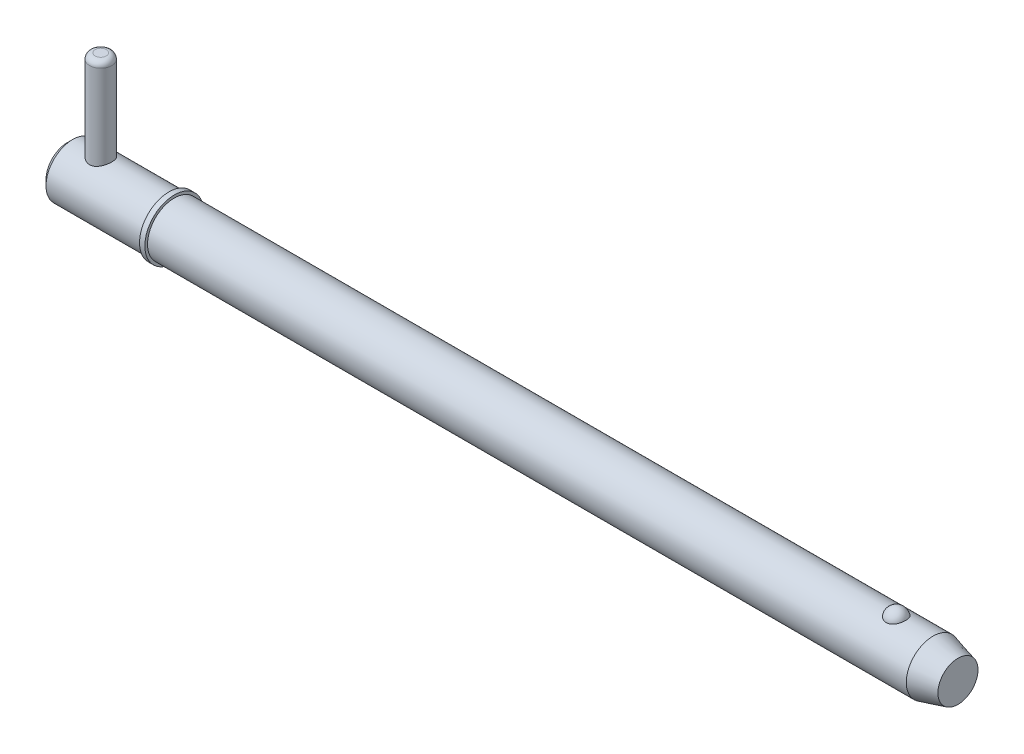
ISO-10303-21;
HEADER;
FILE_DESCRIPTION(('STEP AP214'),'2;1');
FILE_NAME('part.step','',(''),(''),'','','');
FILE_SCHEMA(('AUTOMOTIVE_DESIGN { 1 0 10303 214 1 1 1 1 }'));
ENDSEC;
DATA;
#1=APPLICATION_CONTEXT('core data for automotive mechanical design processes');
#2=APPLICATION_PROTOCOL_DEFINITION('international standard','automotive_design',2000,#1);
#3=PRODUCT_CONTEXT('',#1,'mechanical');
#4=PRODUCT('Part','Part','',(#3));
#5=PRODUCT_RELATED_PRODUCT_CATEGORY('part','',(#4));
#6=PRODUCT_DEFINITION_FORMATION('','',#4);
#7=PRODUCT_DEFINITION_CONTEXT('part definition',#1,'design');
#8=PRODUCT_DEFINITION('design','',#6,#7);
#9=PRODUCT_DEFINITION_SHAPE('','',#8);
#10=(LENGTH_UNIT() NAMED_UNIT(*) SI_UNIT(.MILLI.,.METRE.));
#11=(NAMED_UNIT(*) PLANE_ANGLE_UNIT() SI_UNIT($,.RADIAN.));
#12=(NAMED_UNIT(*) SI_UNIT($,.STERADIAN.) SOLID_ANGLE_UNIT());
#13=UNCERTAINTY_MEASURE_WITH_UNIT(LENGTH_MEASURE(1.E-05),#10,'distance_accuracy_value','');
#14=(GEOMETRIC_REPRESENTATION_CONTEXT(3) GLOBAL_UNCERTAINTY_ASSIGNED_CONTEXT((#13)) GLOBAL_UNIT_ASSIGNED_CONTEXT((#10,
#11,#12)) REPRESENTATION_CONTEXT('',''));
#15=CARTESIAN_POINT('',(0.,0.,0.));
#16=DIRECTION('',(0.,0.,1.));
#17=DIRECTION('',(1.,0.,0.));
#18=AXIS2_PLACEMENT_3D('',#15,#16,#17);
#19=CARTESIAN_POINT('',(5.94,20.635,0.));
#20=DIRECTION('',(0.,-1.,0.));
#21=DIRECTION('',(0.,0.,-1.));
#22=AXIS2_PLACEMENT_3D('',#19,#20,#21);
#23=CYLINDRICAL_SURFACE('',#22,1.98);
#24=CARTESIAN_POINT('',(5.94,-3.775,0.));
#25=DIRECTION('',(0.,1.,0.));
#26=DIRECTION('',(0.,0.,1.));
#27=AXIS2_PLACEMENT_3D('',#24,#25,#26);
#28=CIRCLE('',#27,1.98);
#29=CARTESIAN_POINT('',(5.94,-3.775,1.98));
#30=VERTEX_POINT('',#29);
#31=EDGE_CURVE('P0_E25',#30,#30,#28,.T.);
#32=ORIENTED_EDGE('',*,*,#31,.T.);
#33=EDGE_LOOP('',(#32));
#34=FACE_BOUND('',#33,.T.);
#35=CARTESIAN_POINT('',(5.94,19.645,0.));
#36=DIRECTION('',(0.,1.,0.));
#37=DIRECTION('',(0.,0.,1.));
#38=AXIS2_PLACEMENT_3D('',#35,#36,#37);
#39=CIRCLE('',#38,1.98);
#40=CARTESIAN_POINT('',(5.94,19.645,1.98));
#41=VERTEX_POINT('',#40);
#42=EDGE_CURVE('P0_E29',#41,#41,#39,.F.);
#43=ORIENTED_EDGE('',*,*,#42,.T.);
#44=EDGE_LOOP('',(#43));
#45=FACE_BOUND('',#44,.T.);
#46=ADVANCED_FACE('P0_F14',(#34,#45),#23,.T.);
#47=CARTESIAN_POINT('',(5.94,20.635,0.));
#48=DIRECTION('',(0.,1.,0.));
#49=DIRECTION('',(0.,0.,1.));
#50=AXIS2_PLACEMENT_3D('',#47,#48,#49);
#51=PLANE('',#50);
#52=CARTESIAN_POINT('',(5.94,20.635,0.));
#53=DIRECTION('',(0.,1.,0.));
#54=DIRECTION('',(0.,0.,1.));
#55=AXIS2_PLACEMENT_3D('',#52,#53,#54);
#56=CIRCLE('',#55,0.99);
#57=CARTESIAN_POINT('',(5.94,20.635,0.99));
#58=VERTEX_POINT('',#57);
#59=EDGE_CURVE('P0_E10',#58,#58,#56,.T.);
#60=ORIENTED_EDGE('',*,*,#59,.T.);
#61=EDGE_LOOP('',(#60));
#62=FACE_BOUND('',#61,.T.);
#63=ADVANCED_FACE('P0_F46',(#62),#51,.T.);
#64=CARTESIAN_POINT('',(5.94,-4.765,0.));
#65=DIRECTION('',(0.,1.,0.));
#66=DIRECTION('',(0.,0.,1.));
#67=AXIS2_PLACEMENT_3D('',#64,#65,#66);
#68=PLANE('',#67);
#69=CARTESIAN_POINT('',(5.94,-4.765,0.));
#70=DIRECTION('',(0.,1.,0.));
#71=DIRECTION('',(0.,0.,1.));
#72=AXIS2_PLACEMENT_3D('',#69,#70,#71);
#73=CIRCLE('',#72,0.99);
#74=CARTESIAN_POINT('',(5.94,-4.765,0.99));
#75=VERTEX_POINT('',#74);
#76=EDGE_CURVE('P0_E21',#75,#75,#73,.F.);
#77=ORIENTED_EDGE('',*,*,#76,.T.);
#78=EDGE_LOOP('',(#77));
#79=FACE_BOUND('',#78,.T.);
#80=ADVANCED_FACE('P0_F43',(#79),#68,.F.);
#81=CARTESIAN_POINT('',(5.94,-3.775,0.));
#82=DIRECTION('',(0.,1.,0.));
#83=DIRECTION('',(0.,0.,1.));
#84=AXIS2_PLACEMENT_3D('',#81,#82,#83);
#85=DEGENERATE_TOROIDAL_SURFACE('',#84,0.99,0.99,.T.);
#86=ORIENTED_EDGE('',*,*,#76,.F.);
#87=EDGE_LOOP('',(#86));
#88=FACE_BOUND('',#87,.T.);
#89=ORIENTED_EDGE('',*,*,#31,.F.);
#90=EDGE_LOOP('',(#89));
#91=FACE_BOUND('',#90,.T.);
#92=ADVANCED_FACE('P0_F38',(#88,#91),#85,.T.);
#93=CARTESIAN_POINT('',(5.94,19.645,0.));
#94=DIRECTION('',(0.,1.,0.));
#95=DIRECTION('',(0.,0.,1.));
#96=AXIS2_PLACEMENT_3D('',#93,#94,#95);
#97=DEGENERATE_TOROIDAL_SURFACE('',#96,0.99,0.99,.T.);
#98=ORIENTED_EDGE('',*,*,#42,.F.);
#99=EDGE_LOOP('',(#98));
#100=FACE_BOUND('',#99,.T.);
#101=ORIENTED_EDGE('',*,*,#59,.F.);
#102=EDGE_LOOP('',(#101));
#103=FACE_BOUND('',#102,.T.);
#104=ADVANCED_FACE('P0_F16',(#100,#103),#97,.T.);
#105=CLOSED_SHELL('',(#46,#63,#80,#92,#104));
#106=MANIFOLD_SOLID_BREP('P0_B1',#105);
#107=CARTESIAN_POINT('',(0.,0.,0.));
#108=DIRECTION('',(1.,0.,0.));
#109=DIRECTION('',(0.,0.,-1.));
#110=AXIS2_PLACEMENT_3D('',#107,#108,#109);
#111=CYLINDRICAL_SURFACE('',#110,4.765);
#112=CARTESIAN_POINT('',(154.304194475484,0.,0.));
#113=DIRECTION('',(1.,0.,0.));
#114=DIRECTION('',(0.,0.,-1.));
#115=AXIS2_PLACEMENT_3D('',#112,#113,#114);
#116=CIRCLE('',#115,4.765);
#117=CARTESIAN_POINT('',(154.304194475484,0.,-4.765));
#118=VERTEX_POINT('',#117);
#119=EDGE_CURVE('P1_E81',#118,#118,#116,.T.);
#120=ORIENTED_EDGE('',*,*,#119,.F.);
#121=EDGE_LOOP('',(#120));
#122=FACE_BOUND('',#121,.T.);
#123=CARTESIAN_POINT('',(19.05,0.,0.));
#124=DIRECTION('',(1.,0.,0.));
#125=DIRECTION('',(0.,0.,-1.));
#126=AXIS2_PLACEMENT_3D('',#123,#124,#125);
#127=CIRCLE('',#126,4.765);
#128=CARTESIAN_POINT('',(19.05,0.,-4.765));
#129=VERTEX_POINT('',#128);
#130=EDGE_CURVE('P1_E85',#129,#129,#127,.T.);
#131=ORIENTED_EDGE('',*,*,#130,.T.);
#132=EDGE_LOOP('',(#131));
#133=FACE_BOUND('',#132,.T.);
#134=CARTESIAN_POINT('',(147.751020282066,4.42764777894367,1.76101111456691));
#135=CARTESIAN_POINT('',(147.659721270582,4.42764470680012,1.76101422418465));
#136=CARTESIAN_POINT('',(147.568446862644,4.43059091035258,1.75366340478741));
#137=CARTESIAN_POINT('',(147.388615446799,4.44201846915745,1.72451180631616));
#138=CARTESIAN_POINT('',(147.300057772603,4.45049845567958,1.70271460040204));
#139=CARTESIAN_POINT('',(147.128257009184,4.47200516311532,1.64539370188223));
#140=CARTESIAN_POINT('',(147.045006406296,4.48502527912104,1.60988994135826));
#141=CARTESIAN_POINT('',(146.885763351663,4.51419542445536,1.52617873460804));
#142=CARTESIAN_POINT('',(146.809772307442,4.53034605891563,1.47796883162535));
#143=CARTESIAN_POINT('',(146.664744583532,4.56459317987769,1.36860494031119));
#144=CARTESIAN_POINT('',(146.595964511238,4.58273170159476,1.30712420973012));
#145=CARTESIAN_POINT('',(146.469342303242,4.61870302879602,1.17370204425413));
#146=CARTESIAN_POINT('',(146.411502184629,4.63653577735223,1.10175868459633));
#147=CARTESIAN_POINT('',(146.305570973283,4.67090140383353,0.945806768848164));
#148=CARTESIAN_POINT('',(146.258030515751,4.68734068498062,0.861402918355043));
#149=CARTESIAN_POINT('',(146.177081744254,4.71628466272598,0.685442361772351));
#150=CARTESIAN_POINT('',(146.143674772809,4.72878898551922,0.59388497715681));
#151=CARTESIAN_POINT('',(146.091287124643,4.74874061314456,0.404781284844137));
#152=CARTESIAN_POINT('',(146.072517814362,4.75611366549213,0.307168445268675));
#153=CARTESIAN_POINT('',(146.050584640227,4.76475393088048,0.109940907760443));
#154=CARTESIAN_POINT('',(146.047420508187,4.76602124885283,0.01032624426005));
#155=CARTESIAN_POINT('',(146.056740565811,4.76232928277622,-0.187629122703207));
#156=CARTESIAN_POINT('',(146.069158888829,4.7573962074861,-0.285973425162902));
#157=CARTESIAN_POINT('',(146.109280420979,4.74184975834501,-0.479027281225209));
#158=CARTESIAN_POINT('',(146.136983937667,4.73123627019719,-0.573736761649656));
#159=CARTESIAN_POINT('',(146.207158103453,4.70540026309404,-0.756973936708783));
#160=CARTESIAN_POINT('',(146.249646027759,4.69017235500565,-0.84549425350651));
#161=CARTESIAN_POINT('',(146.348520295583,4.6566986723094,-1.01378033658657));
#162=CARTESIAN_POINT('',(146.404907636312,4.63845268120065,-1.09354547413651));
#163=CARTESIAN_POINT('',(146.530552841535,4.6008543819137,-1.24228523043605));
#164=CARTESIAN_POINT('',(146.599843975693,4.58149930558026,-1.31123108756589));
#165=CARTESIAN_POINT('',(146.749606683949,4.54391653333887,-1.43607409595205));
#166=CARTESIAN_POINT('',(146.830077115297,4.52568872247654,-1.49197257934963));
#167=CARTESIAN_POINT('',(146.998150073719,4.49293007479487,-1.58786764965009));
#168=CARTESIAN_POINT('',(147.085544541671,4.47832346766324,-1.62820219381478));
#169=CARTESIAN_POINT('',(147.266553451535,4.45406011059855,-1.69345757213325));
#170=CARTESIAN_POINT('',(147.36016555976,4.44440151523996,-1.7183841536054));
#171=CARTESIAN_POINT('',(147.545893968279,4.43159888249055,-1.75112843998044));
#172=CARTESIAN_POINT('',(147.637849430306,4.42815213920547,-1.75974223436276));
#173=CARTESIAN_POINT('',(147.821965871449,4.42724735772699,-1.76201865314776));
#174=CARTESIAN_POINT('',(147.914126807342,4.42978816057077,-1.75568417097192));
#175=CARTESIAN_POINT('',(148.093129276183,4.44038648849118,-1.72869560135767));
#176=CARTESIAN_POINT('',(148.180047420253,4.44827555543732,-1.70847853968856));
#177=CARTESIAN_POINT('',(148.349131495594,4.46852246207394,-1.65479562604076));
#178=CARTESIAN_POINT('',(148.431297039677,4.48088066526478,-1.62132869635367));
#179=CARTESIAN_POINT('',(148.590591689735,4.50907357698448,-1.54120560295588));
#180=CARTESIAN_POINT('',(148.667570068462,4.52497884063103,-1.49427526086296));
#181=CARTESIAN_POINT('',(148.812708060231,4.55845148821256,-1.38881222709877));
#182=CARTESIAN_POINT('',(148.880865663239,4.57601924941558,-1.33027689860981));
#183=CARTESIAN_POINT('',(149.010099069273,4.61196537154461,-1.19991049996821));
#184=CARTESIAN_POINT('',(149.070656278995,4.63034074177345,-1.12756415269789));
#185=CARTESIAN_POINT('',(149.179279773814,4.66513959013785,-0.973612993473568));
#186=CARTESIAN_POINT('',(149.227343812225,4.68156271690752,-0.89200652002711));
#187=CARTESIAN_POINT('',(149.311383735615,4.71130224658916,-0.718892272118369));
#188=CARTESIAN_POINT('',(149.346918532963,4.724501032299,-0.627149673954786));
#189=CARTESIAN_POINT('',(149.402952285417,4.74571823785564,-0.438611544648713));
#190=CARTESIAN_POINT('',(149.423450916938,4.75373654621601,-0.341815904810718));
#191=CARTESIAN_POINT('',(149.449033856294,4.76378905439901,-0.145633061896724));
#192=CARTESIAN_POINT('',(149.454076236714,4.76580697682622,-0.0462395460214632));
#193=CARTESIAN_POINT('',(149.448523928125,4.76360573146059,0.152038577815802));
#194=CARTESIAN_POINT('',(149.437929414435,4.75938663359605,0.250923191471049));
#195=CARTESIAN_POINT('',(149.401387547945,4.74516937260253,0.445004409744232));
#196=CARTESIAN_POINT('',(149.375496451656,4.73519238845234,0.54021317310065));
#197=CARTESIAN_POINT('',(149.308927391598,4.7104939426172,0.724662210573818));
#198=CARTESIAN_POINT('',(149.268248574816,4.69577220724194,0.813902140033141));
#199=CARTESIAN_POINT('',(149.172717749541,4.6630376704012,0.984313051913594));
#200=CARTESIAN_POINT('',(149.117804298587,4.64501070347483,1.065446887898));
#201=CARTESIAN_POINT('',(148.995049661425,4.60764678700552,1.21692673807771));
#202=CARTESIAN_POINT('',(148.927208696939,4.5883098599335,1.28727293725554));
#203=CARTESIAN_POINT('',(148.780548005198,4.55060370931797,1.41479271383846));
#204=CARTESIAN_POINT('',(148.701791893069,4.53222967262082,1.47203785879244));
#205=CARTESIAN_POINT('',(148.534989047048,4.49849576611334,1.5721201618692));
#206=CARTESIAN_POINT('',(148.446941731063,4.48313608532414,1.61495641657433));
#207=CARTESIAN_POINT('',(148.259791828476,4.45676184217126,1.68642657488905));
#208=CARTESIAN_POINT('',(148.160365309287,4.44598302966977,1.71430590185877));
#209=CARTESIAN_POINT('',(147.957621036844,4.43142918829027,1.75159258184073));
#210=CARTESIAN_POINT('',(147.854304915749,4.42765125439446,1.76100759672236));
#211=CARTESIAN_POINT('',(147.751020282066,4.42764777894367,1.76101111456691));
#212=B_SPLINE_CURVE_WITH_KNOTS('',3,(#134,#135,#136,#137,#138,#139,#140,#141,#142,#143,#144,
#145,#146,#147,#148,#149,#150,#151,#152,#153,#154,#155,#156,#157,#158,#159,#160,#161,#162,#163,
#164,#165,#166,#167,#168,#169,#170,#171,#172,#173,#174,#175,#176,#177,#178,#179,#180,#181,#182,
#183,#184,#185,#186,#187,#188,#189,#190,#191,#192,#193,#194,#195,#196,#197,#198,#199,#200,#201,
#202,#203,#204,#205,#206,#207,#208,#209,#210,#211),.UNSPECIFIED.,.T.,.F.,(4,2,2,2,2,2,2,2,2,2,2,
2,2,2,2,2,2,2,2,2,2,2,2,2,2,2,2,2,2,2,2,2,2,2,2,2,2,2,4),(0.,0.273517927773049,
0.546968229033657,0.820022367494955,1.09312934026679,1.37393946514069,1.65480131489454,
1.94820420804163,2.24163496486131,2.53922817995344,2.83681628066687,3.13315071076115,
3.42949110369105,3.72617893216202,4.02288805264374,4.32037303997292,4.61782764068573,
4.90840095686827,5.19886582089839,5.4747485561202,5.75057789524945,6.01809977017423,
6.2856434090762,6.5590778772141,6.83257454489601,7.1196298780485,7.40673679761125,
7.7031266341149,7.99952284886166,8.29672237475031,8.59391856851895,8.89002850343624,
9.18615552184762,9.4835826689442,9.78100471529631,10.0767610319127,10.3725358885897,
10.6820893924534,10.9915144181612),.UNSPECIFIED.);
#213=CARTESIAN_POINT('',(147.751020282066,4.42764777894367,1.76101111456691));
#214=VERTEX_POINT('',#213);
#215=EDGE_CURVE('P1_E35',#214,#214,#212,.T.);
#216=ORIENTED_EDGE('',*,*,#215,.T.);
#217=EDGE_LOOP('',(#216));
#218=FACE_BOUND('',#217,.T.);
#219=ADVANCED_FACE('P1_F13',(#122,#133,#218),#111,.T.);
#220=CARTESIAN_POINT('',(0.,0.,0.));
#221=DIRECTION('',(-1.,0.,0.));
#222=DIRECTION('',(0.,0.,1.));
#223=AXIS2_PLACEMENT_3D('',#220,#221,#222);
#224=PLANE('',#223);
#225=CARTESIAN_POINT('',(0.,0.,0.));
#226=DIRECTION('',(1.,0.,0.));
#227=DIRECTION('',(0.,0.,-1.));
#228=AXIS2_PLACEMENT_3D('',#225,#226,#227);
#229=CIRCLE('',#228,3.812);
#230=CARTESIAN_POINT('',(0.,0.,-3.812));
#231=VERTEX_POINT('',#230);
#232=EDGE_CURVE('P1_E9',#231,#231,#229,.T.);
#233=ORIENTED_EDGE('',*,*,#232,.F.);
#234=EDGE_LOOP('',(#233));
#235=FACE_BOUND('',#234,.T.);
#236=ADVANCED_FACE('P1_F15',(#235),#224,.T.);
#237=CARTESIAN_POINT('',(0.952999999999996,0.,0.));
#238=DIRECTION('',(1.,0.,0.));
#239=DIRECTION('',(0.,0.,-1.));
#240=AXIS2_PLACEMENT_3D('',#237,#238,#239);
#241=CONICAL_SURFACE('',#240,4.765,0.78539816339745);
#242=ORIENTED_EDGE('',*,*,#232,.T.);
#243=EDGE_LOOP('',(#242));
#244=FACE_BOUND('',#243,.T.);
#245=CARTESIAN_POINT('',(0.952999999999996,0.,0.));
#246=DIRECTION('',(1.,0.,0.));
#247=DIRECTION('',(0.,0.,-1.));
#248=AXIS2_PLACEMENT_3D('',#245,#246,#247);
#249=CIRCLE('',#248,4.765);
#250=CARTESIAN_POINT('',(0.952999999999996,0.,-4.765));
#251=VERTEX_POINT('',#250);
#252=EDGE_CURVE('P1_E26',#251,#251,#249,.T.);
#253=ORIENTED_EDGE('',*,*,#252,.F.);
#254=EDGE_LOOP('',(#253));
#255=FACE_BOUND('',#254,.T.);
#256=ADVANCED_FACE('P1_F77',(#244,#255),#241,.T.);
#257=CARTESIAN_POINT('',(0.,0.,0.));
#258=DIRECTION('',(1.,0.,0.));
#259=DIRECTION('',(0.,0.,-1.));
#260=AXIS2_PLACEMENT_3D('',#257,#258,#259);
#261=CYLINDRICAL_SURFACE('',#260,4.765);
#262=CARTESIAN_POINT('',(5.94,-4.33414639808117,1.98));
#263=CARTESIAN_POINT('',(5.83435484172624,-4.33415447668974,1.97999169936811));
#264=CARTESIAN_POINT('',(5.72854887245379,-4.33806396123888,1.97149330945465));
#265=CARTESIAN_POINT('',(5.51998191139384,-4.35319906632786,1.93783487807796));
#266=CARTESIAN_POINT('',(5.41723000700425,-4.3644446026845,1.91262947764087));
#267=CARTESIAN_POINT('',(5.21817294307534,-4.39274225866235,1.84670269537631));
#268=CARTESIAN_POINT('',(5.12184344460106,-4.40977076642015,1.80604432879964));
#269=CARTESIAN_POINT('',(4.93740039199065,-4.44768106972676,1.71055160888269));
#270=CARTESIAN_POINT('',(4.84928487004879,-4.46856193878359,1.65572066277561));
#271=CARTESIAN_POINT('',(4.67826533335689,-4.51326966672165,1.52981120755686));
#272=CARTESIAN_POINT('',(4.59593118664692,-4.53719608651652,1.45799365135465));
#273=CARTESIAN_POINT('',(4.44405452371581,-4.58448035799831,1.30170177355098));
#274=CARTESIAN_POINT('',(4.37451692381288,-4.60783798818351,1.21722260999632));
#275=CARTESIAN_POINT('',(4.24730683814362,-4.65256187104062,1.03353484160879));
#276=CARTESIAN_POINT('',(4.19027484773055,-4.67379892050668,0.933848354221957));
#277=CARTESIAN_POINT('',(4.0940363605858,-4.7106711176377,0.7252544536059));
#278=CARTESIAN_POINT('',(4.05482199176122,-4.72630873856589,0.61635113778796));
#279=CARTESIAN_POINT('',(3.99739515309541,-4.74951416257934,0.398397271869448));
#280=CARTESIAN_POINT('',(3.97820018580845,-4.7574579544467,0.289646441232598));
#281=CARTESIAN_POINT('',(3.95818309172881,-4.76574596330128,0.0701967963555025));
#282=CARTESIAN_POINT('',(3.95735355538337,-4.76609324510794,-0.0405012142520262));
#283=CARTESIAN_POINT('',(3.9735743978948,-4.75937098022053,-0.253561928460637));
#284=CARTESIAN_POINT('',(3.98954548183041,-4.75274912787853,-0.356023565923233));
#285=CARTESIAN_POINT('',(4.03706504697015,-4.73344665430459,-0.556659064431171));
#286=CARTESIAN_POINT('',(4.06861467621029,-4.72076558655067,-0.654832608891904));
#287=CARTESIAN_POINT('',(4.14677192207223,-4.69032846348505,-0.845904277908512));
#288=CARTESIAN_POINT('',(4.19360181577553,-4.67249797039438,-0.938699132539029));
#289=CARTESIAN_POINT('',(4.30077315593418,-4.63350852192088,-1.11535616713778));
#290=CARTESIAN_POINT('',(4.3611193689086,-4.61234839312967,-1.19921518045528));
#291=CARTESIAN_POINT('',(4.49853487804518,-4.56707259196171,-1.3618711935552));
#292=CARTESIAN_POINT('',(4.57648039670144,-4.5428537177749,-1.43990029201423));
#293=CARTESIAN_POINT('',(4.74440779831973,-4.49530722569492,-1.58211009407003));
#294=CARTESIAN_POINT('',(4.83439425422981,-4.47197995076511,-1.64628551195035));
#295=CARTESIAN_POINT('',(5.02755026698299,-4.42812342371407,-1.76092221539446));
#296=CARTESIAN_POINT('',(5.13105348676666,-4.40770990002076,-1.81086937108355));
#297=CARTESIAN_POINT('',(5.34607555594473,-4.37336901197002,-1.89231211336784));
#298=CARTESIAN_POINT('',(5.45758864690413,-4.3594370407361,-1.92382080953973));
#299=CARTESIAN_POINT('',(5.67777275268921,-4.34077746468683,-1.96554536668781));
#300=CARTESIAN_POINT('',(5.78616167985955,-4.33551319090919,-1.9770057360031));
#301=CARTESIAN_POINT('',(6.00341835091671,-4.33325118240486,-1.98196183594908));
#302=CARTESIAN_POINT('',(6.11228591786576,-4.33625061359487,-1.97546372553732));
#303=CARTESIAN_POINT('',(6.32012423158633,-4.34962383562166,-1.94582288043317));
#304=CARTESIAN_POINT('',(6.41928436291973,-4.35951709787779,-1.92376364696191));
#305=CARTESIAN_POINT('',(6.61241543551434,-4.38495043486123,-1.86506038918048));
#306=CARTESIAN_POINT('',(6.70638516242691,-4.40049182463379,-1.82841296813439));
#307=CARTESIAN_POINT('',(6.89090272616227,-4.43627016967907,-1.73985559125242));
#308=CARTESIAN_POINT('',(6.98113841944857,-4.45667771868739,-1.68736639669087));
#309=CARTESIAN_POINT('',(7.1519532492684,-4.49964530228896,-1.56919282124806));
#310=CARTESIAN_POINT('',(7.232528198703,-4.52220626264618,-1.50350275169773));
#311=CARTESIAN_POINT('',(7.38851617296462,-4.56914071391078,-1.35452895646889));
#312=CARTESIAN_POINT('',(7.46298462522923,-4.5935132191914,-1.27025197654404));
#313=CARTESIAN_POINT('',(7.59689029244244,-4.63962841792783,-1.08983181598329));
#314=CARTESIAN_POINT('',(7.65632644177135,-4.66137092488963,-0.993687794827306));
#315=CARTESIAN_POINT('',(7.75840361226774,-4.69991192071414,-0.791608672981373));
#316=CARTESIAN_POINT('',(7.80100481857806,-4.71669866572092,-0.685651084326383));
#317=CARTESIAN_POINT('',(7.86746997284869,-4.74331408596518,-0.467197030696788));
#318=CARTESIAN_POINT('',(7.8913450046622,-4.75314687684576,-0.354704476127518));
#319=CARTESIAN_POINT('',(7.91828971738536,-4.76427543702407,-0.134819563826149));
#320=CARTESIAN_POINT('',(7.92269147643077,-4.76611762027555,-0.027616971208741));
#321=CARTESIAN_POINT('',(7.91414154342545,-4.76256684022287,0.185959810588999));
#322=CARTESIAN_POINT('',(7.90119286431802,-4.75717513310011,0.292334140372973));
#323=CARTESIAN_POINT('',(7.85926572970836,-4.74004856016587,0.497383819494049));
#324=CARTESIAN_POINT('',(7.83086647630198,-4.72854322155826,0.596198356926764));
#325=CARTESIAN_POINT('',(7.75947503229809,-4.70045111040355,0.787624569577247));
#326=CARTESIAN_POINT('',(7.71648006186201,-4.68386336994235,0.880235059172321));
#327=CARTESIAN_POINT('',(7.6149456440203,-4.64628321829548,1.06122875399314));
#328=CARTESIAN_POINT('',(7.55579211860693,-4.62512577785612,1.14923242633));
#329=CARTESIAN_POINT('',(7.42451813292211,-4.58091700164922,1.31443888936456));
#330=CARTESIAN_POINT('',(7.35239289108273,-4.5578649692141,1.39163767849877));
#331=CARTESIAN_POINT('',(7.19146107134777,-4.51050832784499,1.53847013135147));
#332=CARTESIAN_POINT('',(7.10185635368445,-4.48622440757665,1.60723941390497));
#333=CARTESIAN_POINT('',(6.91164948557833,-4.44076541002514,1.72888900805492));
#334=CARTESIAN_POINT('',(6.81104124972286,-4.41959206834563,1.78176046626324));
#335=CARTESIAN_POINT('',(6.60181953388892,-4.38318936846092,1.86953227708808));
#336=CARTESIAN_POINT('',(6.49325511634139,-4.3679267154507,1.90453365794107));
#337=CARTESIAN_POINT('',(6.32681512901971,-4.35102038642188,1.94268459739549));
#338=CARTESIAN_POINT('',(6.27079191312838,-4.34638447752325,1.953006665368));
#339=CARTESIAN_POINT('',(6.15793999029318,-4.33925923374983,1.96879053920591));
#340=CARTESIAN_POINT('',(6.10111188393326,-4.33676837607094,1.97425579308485));
#341=CARTESIAN_POINT('',(6.00947316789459,-4.33456308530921,1.97908711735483));
#342=CARTESIAN_POINT('',(5.97474528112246,-4.33414374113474,1.98000272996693));
#343=CARTESIAN_POINT('',(5.94,-4.33414639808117,1.98));
#344=B_SPLINE_CURVE_WITH_KNOTS('',3,(#262,#263,#264,#265,#266,#267,#268,#269,#270,#271,#272,
#273,#274,#275,#276,#277,#278,#279,#280,#281,#282,#283,#284,#285,#286,#287,#288,#289,#290,#291,
#292,#293,#294,#295,#296,#297,#298,#299,#300,#301,#302,#303,#304,#305,#306,#307,#308,#309,#310,
#311,#312,#313,#314,#315,#316,#317,#318,#319,#320,#321,#322,#323,#324,#325,#326,#327,#328,#329,
#330,#331,#332,#333,#334,#335,#336,#337,#338,#339,#340,#341,#342,#343),.UNSPECIFIED.,.T.,.F.,(4,
2,2,2,2,2,2,2,2,2,2,2,2,2,2,2,2,2,2,2,2,2,2,2,2,2,2,2,2,2,2,2,2,2,2,2,2,2,2,2,4),(0.,
0.316814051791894,0.634491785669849,0.950887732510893,1.2672076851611,1.60127705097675,
1.93547449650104,2.28407463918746,2.63252061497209,2.96292077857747,3.29318763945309,
3.60346227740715,3.91375978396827,4.22878888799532,4.54392926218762,4.88117914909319,
5.21855748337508,5.56691259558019,5.91501972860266,6.24062939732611,6.56612741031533,
6.87094948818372,7.17584258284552,7.49361276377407,7.81152017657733,8.15513975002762,
8.4987836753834,8.8432355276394,9.18748334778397,9.50777781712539,9.8280166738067,
10.1370037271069,10.4460496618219,10.7690461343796,11.0921619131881,11.4371238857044,
11.7822776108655,12.1254577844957,12.2967183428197,12.4678572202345,12.5720531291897),.UNSPECIFIED.);
#345=CARTESIAN_POINT('',(5.94,-4.33414639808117,1.98));
#346=VERTEX_POINT('',#345);
#347=EDGE_CURVE('P1_E17',#346,#346,#344,.T.);
#348=ORIENTED_EDGE('',*,*,#347,.F.);
#349=EDGE_LOOP('',(#348));
#350=FACE_BOUND('',#349,.T.);
#351=CARTESIAN_POINT('',(5.94,4.33414639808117,1.98));
#352=CARTESIAN_POINT('',(6.04564515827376,4.33415447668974,1.97999169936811));
#353=CARTESIAN_POINT('',(6.15145112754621,4.33806396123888,1.97149330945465));
#354=CARTESIAN_POINT('',(6.36001808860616,4.35319906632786,1.93783487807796));
#355=CARTESIAN_POINT('',(6.46276999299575,4.3644446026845,1.91262947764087));
#356=CARTESIAN_POINT('',(6.66182705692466,4.39274225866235,1.84670269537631));
#357=CARTESIAN_POINT('',(6.75815655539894,4.40977076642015,1.80604432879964));
#358=CARTESIAN_POINT('',(6.94259960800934,4.44768106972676,1.71055160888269));
#359=CARTESIAN_POINT('',(7.03071512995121,4.46856193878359,1.65572066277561));
#360=CARTESIAN_POINT('',(7.20173466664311,4.51326966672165,1.52981120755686));
#361=CARTESIAN_POINT('',(7.28406881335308,4.53719608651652,1.45799365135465));
#362=CARTESIAN_POINT('',(7.43594547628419,4.58448035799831,1.30170177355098));
#363=CARTESIAN_POINT('',(7.50548307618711,4.60783798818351,1.21722260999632));
#364=CARTESIAN_POINT('',(7.63269316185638,4.65256187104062,1.03353484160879));
#365=CARTESIAN_POINT('',(7.68972515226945,4.67379892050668,0.933848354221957));
#366=CARTESIAN_POINT('',(7.7859636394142,4.7106711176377,0.7252544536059));
#367=CARTESIAN_POINT('',(7.82517800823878,4.72630873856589,0.61635113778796));
#368=CARTESIAN_POINT('',(7.88260484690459,4.74951416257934,0.398397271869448));
#369=CARTESIAN_POINT('',(7.90179981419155,4.7574579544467,0.289646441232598));
#370=CARTESIAN_POINT('',(7.92181690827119,4.76574596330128,0.0701967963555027));
#371=CARTESIAN_POINT('',(7.92264644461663,4.76609324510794,-0.040501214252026));
#372=CARTESIAN_POINT('',(7.9064256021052,4.75937098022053,-0.253561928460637));
#373=CARTESIAN_POINT('',(7.89045451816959,4.75274912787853,-0.356023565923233));
#374=CARTESIAN_POINT('',(7.84293495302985,4.73344665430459,-0.55665906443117));
#375=CARTESIAN_POINT('',(7.81138532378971,4.72076558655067,-0.654832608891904));
#376=CARTESIAN_POINT('',(7.73322807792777,4.69032846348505,-0.845904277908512));
#377=CARTESIAN_POINT('',(7.68639818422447,4.67249797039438,-0.938699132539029));
#378=CARTESIAN_POINT('',(7.57922684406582,4.63350852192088,-1.11535616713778));
#379=CARTESIAN_POINT('',(7.5188806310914,4.61234839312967,-1.19921518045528));
#380=CARTESIAN_POINT('',(7.38146512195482,4.56707259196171,-1.3618711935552));
#381=CARTESIAN_POINT('',(7.30351960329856,4.5428537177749,-1.43990029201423));
#382=CARTESIAN_POINT('',(7.13559220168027,4.49530722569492,-1.58211009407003));
#383=CARTESIAN_POINT('',(7.04560574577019,4.47197995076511,-1.64628551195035));
#384=CARTESIAN_POINT('',(6.85244973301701,4.42812342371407,-1.76092221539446));
#385=CARTESIAN_POINT('',(6.74894651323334,4.40770990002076,-1.81086937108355));
#386=CARTESIAN_POINT('',(6.53392444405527,4.37336901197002,-1.89231211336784));
#387=CARTESIAN_POINT('',(6.42241135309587,4.3594370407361,-1.92382080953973));
#388=CARTESIAN_POINT('',(6.20222724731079,4.34077746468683,-1.96554536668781));
#389=CARTESIAN_POINT('',(6.09383832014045,4.33551319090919,-1.9770057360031));
#390=CARTESIAN_POINT('',(5.87658164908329,4.33325118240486,-1.98196183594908));
#391=CARTESIAN_POINT('',(5.76771408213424,4.33625061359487,-1.97546372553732));
#392=CARTESIAN_POINT('',(5.55987576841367,4.34962383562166,-1.94582288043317));
#393=CARTESIAN_POINT('',(5.46071563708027,4.35951709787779,-1.92376364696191));
#394=CARTESIAN_POINT('',(5.26758456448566,4.38495043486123,-1.86506038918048));
#395=CARTESIAN_POINT('',(5.17361483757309,4.40049182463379,-1.82841296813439));
#396=CARTESIAN_POINT('',(4.98909727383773,4.43627016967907,-1.73985559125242));
#397=CARTESIAN_POINT('',(4.89886158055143,4.45667771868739,-1.68736639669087));
#398=CARTESIAN_POINT('',(4.72804675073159,4.49964530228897,-1.56919282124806));
#399=CARTESIAN_POINT('',(4.647471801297,4.52220626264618,-1.50350275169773));
#400=CARTESIAN_POINT('',(4.49148382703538,4.56914071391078,-1.35452895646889));
#401=CARTESIAN_POINT('',(4.41701537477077,4.5935132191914,-1.27025197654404));
#402=CARTESIAN_POINT('',(4.28310970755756,4.63962841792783,-1.08983181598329));
#403=CARTESIAN_POINT('',(4.22367355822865,4.66137092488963,-0.993687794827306));
#404=CARTESIAN_POINT('',(4.12159638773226,4.69991192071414,-0.791608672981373));
#405=CARTESIAN_POINT('',(4.07899518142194,4.71669866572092,-0.685651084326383));
#406=CARTESIAN_POINT('',(4.01253002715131,4.74331408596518,-0.467197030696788));
#407=CARTESIAN_POINT('',(3.98865499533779,4.75314687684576,-0.354704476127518));
#408=CARTESIAN_POINT('',(3.96171028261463,4.76427543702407,-0.134819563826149));
#409=CARTESIAN_POINT('',(3.95730852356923,4.76611762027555,-0.0276169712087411));
#410=CARTESIAN_POINT('',(3.96585845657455,4.76256684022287,0.185959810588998));
#411=CARTESIAN_POINT('',(3.97880713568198,4.75717513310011,0.292334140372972));
#412=CARTESIAN_POINT('',(4.02073427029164,4.74004856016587,0.497383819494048));
#413=CARTESIAN_POINT('',(4.04913352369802,4.72854322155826,0.596198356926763));
#414=CARTESIAN_POINT('',(4.12052496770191,4.70045111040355,0.787624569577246));
#415=CARTESIAN_POINT('',(4.16351993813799,4.68386336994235,0.880235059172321));
#416=CARTESIAN_POINT('',(4.2650543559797,4.64628321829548,1.06122875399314));
#417=CARTESIAN_POINT('',(4.32420788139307,4.62512577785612,1.14923242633));
#418=CARTESIAN_POINT('',(4.45548186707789,4.58091700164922,1.31443888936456));
#419=CARTESIAN_POINT('',(4.52760710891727,4.5578649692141,1.39163767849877));
#420=CARTESIAN_POINT('',(4.68853892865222,4.51050832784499,1.53847013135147));
#421=CARTESIAN_POINT('',(4.77814364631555,4.48622440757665,1.60723941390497));
#422=CARTESIAN_POINT('',(4.96835051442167,4.44076541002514,1.72888900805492));
#423=CARTESIAN_POINT('',(5.06895875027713,4.41959206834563,1.78176046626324));
#424=CARTESIAN_POINT('',(5.27818046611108,4.38318936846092,1.86953227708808));
#425=CARTESIAN_POINT('',(5.38674488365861,4.3679267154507,1.90453365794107));
#426=CARTESIAN_POINT('',(5.55318487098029,4.35102038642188,1.94268459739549));
#427=CARTESIAN_POINT('',(5.60920808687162,4.34638447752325,1.953006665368));
#428=CARTESIAN_POINT('',(5.72206000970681,4.33925923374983,1.96879053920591));
#429=CARTESIAN_POINT('',(5.77888811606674,4.33676837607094,1.97425579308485));
#430=CARTESIAN_POINT('',(5.87052683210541,4.33456308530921,1.97908711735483));
#431=CARTESIAN_POINT('',(5.90525471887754,4.33414374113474,1.98000272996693));
#432=CARTESIAN_POINT('',(5.94,4.33414639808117,1.98));
#433=B_SPLINE_CURVE_WITH_KNOTS('',3,(#351,#352,#353,#354,#355,#356,#357,#358,#359,#360,#361,
#362,#363,#364,#365,#366,#367,#368,#369,#370,#371,#372,#373,#374,#375,#376,#377,#378,#379,#380,
#381,#382,#383,#384,#385,#386,#387,#388,#389,#390,#391,#392,#393,#394,#395,#396,#397,#398,#399,
#400,#401,#402,#403,#404,#405,#406,#407,#408,#409,#410,#411,#412,#413,#414,#415,#416,#417,#418,
#419,#420,#421,#422,#423,#424,#425,#426,#427,#428,#429,#430,#431,#432),.UNSPECIFIED.,.T.,.F.,(4,
2,2,2,2,2,2,2,2,2,2,2,2,2,2,2,2,2,2,2,2,2,2,2,2,2,2,2,2,2,2,2,2,2,2,2,2,2,2,2,4),(0.,
0.316814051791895,0.634491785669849,0.950887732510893,1.2672076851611,1.60127705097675,
1.93547449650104,2.28407463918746,2.63252061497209,2.96292077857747,3.29318763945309,
3.60346227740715,3.91375978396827,4.22878888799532,4.54392926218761,4.88117914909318,
5.21855748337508,5.56691259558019,5.91501972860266,6.24062939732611,6.56612741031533,
6.87094948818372,7.17584258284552,7.49361276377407,7.81152017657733,8.15513975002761,
8.4987836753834,8.84323552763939,9.18748334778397,9.50777781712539,9.8280166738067,
10.1370037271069,10.4460496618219,10.7690461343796,11.0921619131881,11.4371238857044,
11.7822776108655,12.1254577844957,12.2967183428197,12.4678572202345,12.5720531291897),.UNSPECIFIED.);
#434=CARTESIAN_POINT('',(5.94,4.33414639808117,1.98));
#435=VERTEX_POINT('',#434);
#436=EDGE_CURVE('P1_E43',#435,#435,#433,.T.);
#437=ORIENTED_EDGE('',*,*,#436,.F.);
#438=EDGE_LOOP('',(#437));
#439=FACE_BOUND('',#438,.T.);
#440=ORIENTED_EDGE('',*,*,#252,.T.);
#441=EDGE_LOOP('',(#440));
#442=FACE_BOUND('',#441,.T.);
#443=CARTESIAN_POINT('',(18.097,0.,0.));
#444=DIRECTION('',(1.,0.,0.));
#445=DIRECTION('',(0.,0.,-1.));
#446=AXIS2_PLACEMENT_3D('',#443,#444,#445);
#447=CIRCLE('',#446,4.765);
#448=CARTESIAN_POINT('',(18.097,0.,-4.765));
#449=VERTEX_POINT('',#448);
#450=EDGE_CURVE('P1_E31',#449,#449,#447,.T.);
#451=ORIENTED_EDGE('',*,*,#450,.F.);
#452=EDGE_LOOP('',(#451));
#453=FACE_BOUND('',#452,.T.);
#454=ADVANCED_FACE('P1_F103',(#350,#439,#442,#453),#261,.T.);
#455=CARTESIAN_POINT('',(18.097,4.765,0.));
#456=DIRECTION('',(-1.,0.,0.));
#457=DIRECTION('',(0.,0.,1.));
#458=AXIS2_PLACEMENT_3D('',#455,#456,#457);
#459=PLANE('',#458);
#460=ORIENTED_EDGE('',*,*,#450,.T.);
#461=EDGE_LOOP('',(#460));
#462=FACE_BOUND('',#461,.T.);
#463=CARTESIAN_POINT('',(18.097,0.,0.));
#464=DIRECTION('',(1.,0.,0.));
#465=DIRECTION('',(0.,0.,-1.));
#466=AXIS2_PLACEMENT_3D('',#463,#464,#465);
#467=CIRCLE('',#466,5.2415);
#468=CARTESIAN_POINT('',(18.097,0.,-5.2415));
#469=VERTEX_POINT('',#468);
#470=EDGE_CURVE('P1_E91',#469,#469,#467,.T.);
#471=ORIENTED_EDGE('',*,*,#470,.F.);
#472=EDGE_LOOP('',(#471));
#473=FACE_BOUND('',#472,.T.);
#474=ADVANCED_FACE('P1_F100',(#462,#473),#459,.T.);
#475=CARTESIAN_POINT('',(0.,0.,0.));
#476=DIRECTION('',(1.,0.,0.));
#477=DIRECTION('',(0.,0.,-1.));
#478=AXIS2_PLACEMENT_3D('',#475,#476,#477);
#479=CYLINDRICAL_SURFACE('',#478,5.2415);
#480=ORIENTED_EDGE('',*,*,#470,.T.);
#481=EDGE_LOOP('',(#480));
#482=FACE_BOUND('',#481,.T.);
#483=CARTESIAN_POINT('',(19.05,0.,0.));
#484=DIRECTION('',(1.,0.,0.));
#485=DIRECTION('',(0.,0.,-1.));
#486=AXIS2_PLACEMENT_3D('',#483,#484,#485);
#487=CIRCLE('',#486,5.2415);
#488=CARTESIAN_POINT('',(19.05,0.,-5.2415));
#489=VERTEX_POINT('',#488);
#490=EDGE_CURVE('P1_E88',#489,#489,#487,.T.);
#491=ORIENTED_EDGE('',*,*,#490,.F.);
#492=EDGE_LOOP('',(#491));
#493=FACE_BOUND('',#492,.T.);
#494=ADVANCED_FACE('P1_F68',(#482,#493),#479,.T.);
#495=CARTESIAN_POINT('',(19.05,5.2415,0.));
#496=DIRECTION('',(1.,0.,0.));
#497=DIRECTION('',(0.,0.,-1.));
#498=AXIS2_PLACEMENT_3D('',#495,#496,#497);
#499=PLANE('',#498);
#500=ORIENTED_EDGE('',*,*,#490,.T.);
#501=EDGE_LOOP('',(#500));
#502=FACE_BOUND('',#501,.T.);
#503=ORIENTED_EDGE('',*,*,#130,.F.);
#504=EDGE_LOOP('',(#503));
#505=FACE_BOUND('',#504,.T.);
#506=ADVANCED_FACE('P1_F62',(#502,#505),#499,.T.);
#507=CARTESIAN_POINT('',(158.75,0.,0.));
#508=DIRECTION('',(-1.,0.,0.));
#509=DIRECTION('',(0.,0.,1.));
#510=AXIS2_PLACEMENT_3D('',#507,#508,#509);
#511=CONICAL_SURFACE('',#510,3.57375000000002,0.261799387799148);
#512=ORIENTED_EDGE('',*,*,#119,.T.);
#513=EDGE_LOOP('',(#512));
#514=FACE_BOUND('',#513,.T.);
#515=CARTESIAN_POINT('',(158.75,0.,0.));
#516=DIRECTION('',(1.,0.,0.));
#517=DIRECTION('',(0.,0.,-1.));
#518=AXIS2_PLACEMENT_3D('',#515,#516,#517);
#519=CIRCLE('',#518,3.57375000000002);
#520=CARTESIAN_POINT('',(158.75,0.,-3.57375000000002));
#521=VERTEX_POINT('',#520);
#522=EDGE_CURVE('P1_E42',#521,#521,#519,.T.);
#523=ORIENTED_EDGE('',*,*,#522,.F.);
#524=EDGE_LOOP('',(#523));
#525=FACE_BOUND('',#524,.T.);
#526=ADVANCED_FACE('P1_F59',(#514,#525),#511,.T.);
#527=CARTESIAN_POINT('',(158.75,3.57375000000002,0.));
#528=DIRECTION('',(1.,0.,0.));
#529=DIRECTION('',(0.,0.,-1.));
#530=AXIS2_PLACEMENT_3D('',#527,#528,#529);
#531=PLANE('',#530);
#532=ORIENTED_EDGE('',*,*,#522,.T.);
#533=EDGE_LOOP('',(#532));
#534=FACE_BOUND('',#533,.T.);
#535=ADVANCED_FACE('P1_F55',(#534),#531,.T.);
#536=CARTESIAN_POINT('',(147.751020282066,4.2885,0.));
#537=DIRECTION('',(-1.,0.,0.));
#538=DIRECTION('',(0.,1.,0.));
#539=AXIS2_PLACEMENT_3D('',#536,#537,#538);
#540=SPHERICAL_SURFACE('',#539,1.76650000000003);
#541=ORIENTED_EDGE('',*,*,#215,.F.);
#542=EDGE_LOOP('',(#541));
#543=FACE_BOUND('',#542,.T.);
#544=ADVANCED_FACE('P1_F50',(#543),#540,.T.);
#545=CARTESIAN_POINT('',(5.94,-5.2415,0.));
#546=DIRECTION('',(0.,1.,0.));
#547=DIRECTION('',(0.,0.,1.));
#548=AXIS2_PLACEMENT_3D('',#545,#546,#547);
#549=CYLINDRICAL_SURFACE('',#548,1.98);
#550=ORIENTED_EDGE('',*,*,#347,.T.);
#551=EDGE_LOOP('',(#550));
#552=FACE_BOUND('',#551,.T.);
#553=ORIENTED_EDGE('',*,*,#436,.T.);
#554=EDGE_LOOP('',(#553));
#555=FACE_BOUND('',#554,.T.);
#556=ADVANCED_FACE('P1_F54',(#552,#555),#549,.F.);
#557=CLOSED_SHELL('',(#219,#236,#256,#454,#474,#494,#506,#526,#535,#544,#556));
#558=MANIFOLD_SOLID_BREP('P1_B1',#557);
#559=ADVANCED_BREP_SHAPE_REPRESENTATION('',(#18,#106,#558),#14);
#560=SHAPE_DEFINITION_REPRESENTATION(#9,#559);
ENDSEC;
END-ISO-10303-21;
